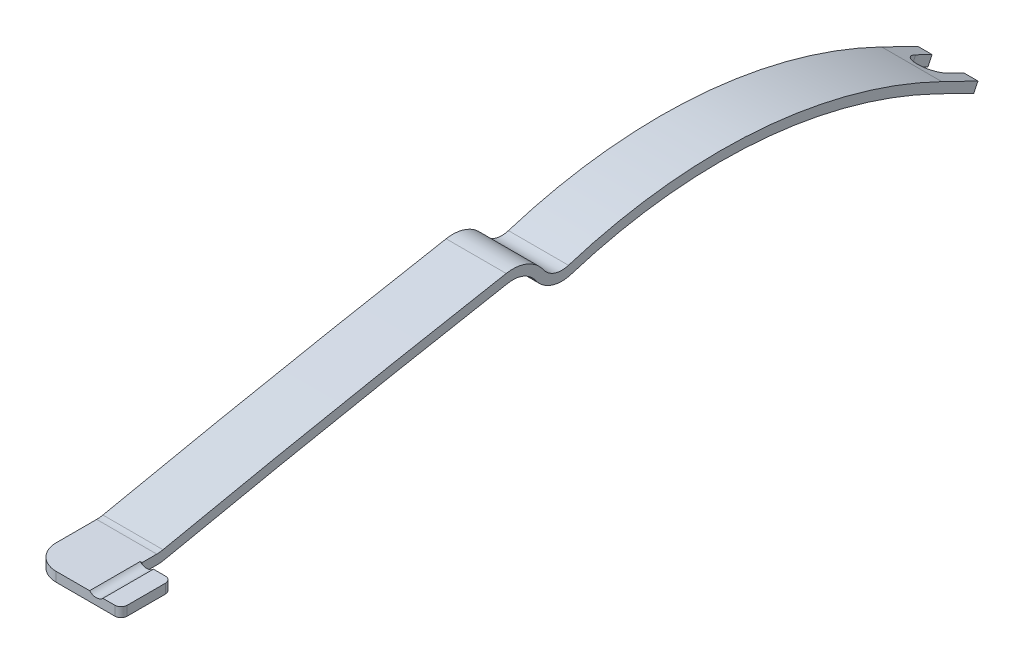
from build123d import *

# Parameters (mm, degrees)
EXTRUDE_1_DEPTH     = 7.6962
CUT_EXTRUDE_1_DEPTH = 71.168074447
EXTRUDE_2_DEPTH     = 1.21412
FILLET_1_R          = 3.175
SKETCH_4_R          = 1.190625
CUT_EXTRUDE_2_DEPTH = 6.477


with BuildPart() as part:
    # Sketch 1 → Extrude 1 (new body)
    with BuildSketch(Plane(origin=(0, 0, 0), x_dir=(0, 0, -1), z_dir=(1, 0, 0))):
        with BuildLine():
            Line((-53.34, 0), (-44.984535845, 0))
            ThreePointArc((-44.984535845, 0), (-44.453382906, 0.027844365), (-43.928052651, 0.111072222))
            ThreePointArc((-43.928052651, 0.111072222), (-21.996268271, 4.603704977), (0, 8.769169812))
            ThreePointArc((0, 8.769169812), (1.999332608, 8.554546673), (3.562601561, 7.2898))
            ThreePointArc((3.562601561, 7.2898), (5.587161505, 5.754186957), (8.128, 5.721169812))
            ThreePointArc((8.128, 5.721169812), (31.920949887, 8.484403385), (55.049708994, 2.255404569))
            Line((55.049708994, 2.255404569), (59.69, 0))
            Line((59.69, 0), (60.220748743, 1.091967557))
            Line((60.220748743, 1.091967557), (55.580457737, 3.347372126))
            ThreePointArc((55.580457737, 3.347372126), (32.010384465, 9.695224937), (7.763447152, 6.879266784))
            ThreePointArc((7.763447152, 6.879266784), (5.981684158, 6.902420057), (4.561961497, 7.979268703))
            ThreePointArc((4.561961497, 7.979268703), (2.464947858, 9.675836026), (-0.217014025, 9.963737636))
            ThreePointArc((-0.217014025, 9.963737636), (-22.231051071, 5.794907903), (-44.180552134, 1.298645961))
            ThreePointArc((-44.180552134, 1.298645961), (-44.580328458, 1.235309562), (-44.984535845, 1.21412))
            Line((-44.984535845, 1.21412), (-53.34, 1.21412))
            Line((-53.34, 1.21412), (-53.34, 0))
        make_face()
    extrude(amount=EXTRUDE_1_DEPTH)

    # Sketch 2 → Cut-Extrude 1 (cut, through all)
    with BuildSketch(Plane(origin=(0, 24.560020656, -11.937351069), x_dir=(1, 0, 0), z_dir=(0, 0.899390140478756, -0.437146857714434))):
        with BuildLine():
            Line((1.8161, 51.350972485), (1.8161, 53.684597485))
            Line((1.8161, 53.684597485), (5.8801, 53.684597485))
            Line((5.8801, 53.684597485), (5.8801, 51.350972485))
            ThreePointArc((5.8801, 51.350972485), (3.8481, 49.318972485), (1.8161, 51.350972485))
        make_face()
    extrude(amount=-CUT_EXTRUDE_1_DEPTH, mode=Mode.SUBTRACT)

    # Sketch 3 → Extrude 2 (add)
    with BuildSketch(Plane(origin=(0, 1.21412, 0), x_dir=(1, 0, 0), z_dir=(0, 1, 0))):
        with BuildLine():
            Line((7.6962, -53.34), (10.68705, -53.34))
            ThreePointArc((10.68705, -53.34), (11.248316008, -53.107516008), (11.4808, -52.54625))
            Line((11.4808, -52.54625), (11.4808, -47.65675))
            ThreePointArc((11.4808, -47.65675), (11.248316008, -47.095483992), (10.68705, -46.863))
            Line((10.68705, -46.863), (7.6962, -46.863))
            Line((7.6962, -46.863), (7.6962, -53.34))
        make_face()
    extrude(amount=-EXTRUDE_2_DEPTH)

    # Fillet 1
    fillet_1_edges = [part.edges().sort_by_distance(p)[0] for p in [
        (0, 0.60706, 53.34),
    ]]
    fillet(fillet_1_edges, radius=FILLET_1_R)

    # Sketch 4 → Cut-Extrude 2 (cut)
    with BuildSketch(Plane(origin=(0, 0, 46.863), x_dir=(-1, 0, 0), z_dir=(0, 0, -1))):
        with Locations((-8.3058, 2.049145)):
            Circle(SKETCH_4_R)
    extrude(amount=-CUT_EXTRUDE_2_DEPTH, mode=Mode.SUBTRACT)


solid = part.part
